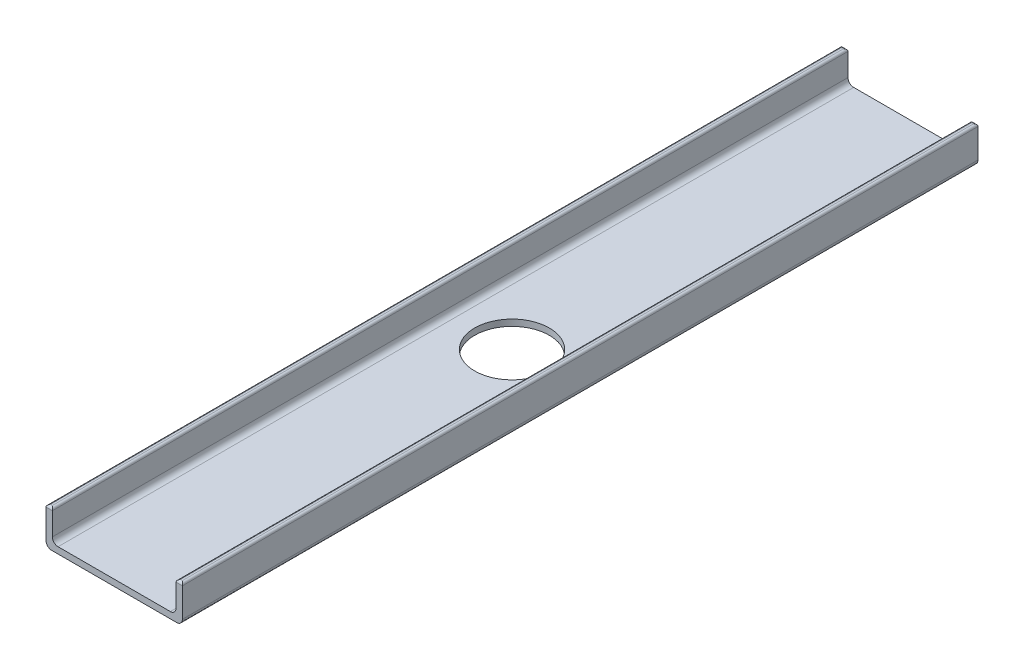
ISO-10303-21;
HEADER;
FILE_DESCRIPTION(('STEP AP214'),'2;1');
FILE_NAME('part.step','',(''),(''),'','','');
FILE_SCHEMA(('AUTOMOTIVE_DESIGN { 1 0 10303 214 1 1 1 1 }'));
ENDSEC;
DATA;
#1=APPLICATION_CONTEXT('core data for automotive mechanical design processes');
#2=APPLICATION_PROTOCOL_DEFINITION('international standard','automotive_design',2000,#1);
#3=PRODUCT_CONTEXT('',#1,'mechanical');
#4=PRODUCT('Part','Part','',(#3));
#5=PRODUCT_RELATED_PRODUCT_CATEGORY('part','',(#4));
#6=PRODUCT_DEFINITION_FORMATION('','',#4);
#7=PRODUCT_DEFINITION_CONTEXT('part definition',#1,'design');
#8=PRODUCT_DEFINITION('design','',#6,#7);
#9=PRODUCT_DEFINITION_SHAPE('','',#8);
#10=(LENGTH_UNIT() NAMED_UNIT(*) SI_UNIT(.MILLI.,.METRE.));
#11=(NAMED_UNIT(*) PLANE_ANGLE_UNIT() SI_UNIT($,.RADIAN.));
#12=(NAMED_UNIT(*) SI_UNIT($,.STERADIAN.) SOLID_ANGLE_UNIT());
#13=UNCERTAINTY_MEASURE_WITH_UNIT(LENGTH_MEASURE(1.E-05),#10,'distance_accuracy_value','');
#14=(GEOMETRIC_REPRESENTATION_CONTEXT(3) GLOBAL_UNCERTAINTY_ASSIGNED_CONTEXT((#13)) GLOBAL_UNIT_ASSIGNED_CONTEXT((#10,
#11,#12)) REPRESENTATION_CONTEXT('',''));
#15=CARTESIAN_POINT('',(0.,0.,0.));
#16=DIRECTION('',(0.,0.,1.));
#17=DIRECTION('',(1.,0.,0.));
#18=AXIS2_PLACEMENT_3D('',#15,#16,#17);
#19=CARTESIAN_POINT('',(-76.2,41.275,-863.6));
#20=DIRECTION('',(-1.,0.,0.));
#21=DIRECTION('',(0.,0.,1.));
#22=AXIS2_PLACEMENT_3D('',#19,#20,#21);
#23=PLANE('',#22);
#24=DIRECTION('',(0.,-1.,0.));
#25=VECTOR('',#24,1.);
#26=CARTESIAN_POINT('',(-76.2,41.275,25.4));
#27=LINE('',#26,#25);
#28=CARTESIAN_POINT('',(-76.2,38.735,25.4));
#29=VERTEX_POINT('',#28);
#30=CARTESIAN_POINT('',(-76.2,6.35,25.4));
#31=VERTEX_POINT('',#30);
#32=EDGE_CURVE('E242',#29,#31,#27,.T.);
#33=ORIENTED_EDGE('',*,*,#32,.F.);
#34=DIRECTION('',(0.,0.,1.));
#35=VECTOR('',#34,1.);
#36=CARTESIAN_POINT('',(-76.2,38.735,-863.6));
#37=LINE('',#36,#35);
#38=CARTESIAN_POINT('',(-76.2,38.735,-863.6));
#39=VERTEX_POINT('',#38);
#40=EDGE_CURVE('E43',#29,#39,#37,.F.);
#41=ORIENTED_EDGE('',*,*,#40,.T.);
#42=DIRECTION('',(0.,-1.,0.));
#43=VECTOR('',#42,1.);
#44=CARTESIAN_POINT('',(-76.2,41.275,-863.6));
#45=LINE('',#44,#43);
#46=CARTESIAN_POINT('',(-76.2,6.35,-863.6));
#47=VERTEX_POINT('',#46);
#48=EDGE_CURVE('E159',#39,#47,#45,.T.);
#49=ORIENTED_EDGE('',*,*,#48,.T.);
#50=DIRECTION('',(0.,0.,1.));
#51=VECTOR('',#50,1.);
#52=CARTESIAN_POINT('',(-76.2,6.35,-863.6));
#53=LINE('',#52,#51);
#54=EDGE_CURVE('E169',#47,#31,#53,.T.);
#55=ORIENTED_EDGE('',*,*,#54,.T.);
#56=EDGE_LOOP('',(#33,#41,#49,#55));
#57=FACE_BOUND('',#56,.T.);
#58=ADVANCED_FACE('F35',(#57),#23,.T.);
#59=CARTESIAN_POINT('',(-69.088,41.275,-863.6));
#60=DIRECTION('',(0.,1.,0.));
#61=DIRECTION('',(0.,0.,1.));
#62=AXIS2_PLACEMENT_3D('',#59,#60,#61);
#63=PLANE('',#62);
#64=DIRECTION('',(0.,0.,1.));
#65=VECTOR('',#64,1.);
#66=CARTESIAN_POINT('',(-73.66,41.275,-863.6));
#67=LINE('',#66,#65);
#68=CARTESIAN_POINT('',(-73.66,41.275,-861.06));
#69=VERTEX_POINT('',#68);
#70=CARTESIAN_POINT('',(-73.66,41.275,22.86));
#71=VERTEX_POINT('',#70);
#72=EDGE_CURVE('E50',#69,#71,#67,.T.);
#73=ORIENTED_EDGE('',*,*,#72,.T.);
#74=DIRECTION('',(-1.,0.,0.));
#75=VECTOR('',#74,1.);
#76=CARTESIAN_POINT('',(-69.088,41.275,22.86));
#77=LINE('',#76,#75);
#78=CARTESIAN_POINT('',(-71.628,41.275,22.86));
#79=VERTEX_POINT('',#78);
#80=EDGE_CURVE('E237',#71,#79,#77,.F.);
#81=ORIENTED_EDGE('',*,*,#80,.T.);
#82=DIRECTION('',(0.,0.,1.));
#83=VECTOR('',#82,1.);
#84=CARTESIAN_POINT('',(-71.628,41.275,-863.6));
#85=LINE('',#84,#83);
#86=CARTESIAN_POINT('',(-71.628,41.275,-861.06));
#87=VERTEX_POINT('',#86);
#88=EDGE_CURVE('E233',#79,#87,#85,.F.);
#89=ORIENTED_EDGE('',*,*,#88,.T.);
#90=DIRECTION('',(-1.,0.,0.));
#91=VECTOR('',#90,1.);
#92=CARTESIAN_POINT('',(-69.088,41.275,-861.06));
#93=LINE('',#92,#91);
#94=EDGE_CURVE('E55',#87,#69,#93,.T.);
#95=ORIENTED_EDGE('',*,*,#94,.T.);
#96=EDGE_LOOP('',(#73,#81,#89,#95));
#97=FACE_BOUND('',#96,.T.);
#98=ADVANCED_FACE('F37',(#97),#63,.T.);
#99=CARTESIAN_POINT('',(-69.088,7.11200000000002,-863.6));
#100=DIRECTION('',(1.,0.,0.));
#101=DIRECTION('',(0.,0.,-1.));
#102=AXIS2_PLACEMENT_3D('',#99,#100,#101);
#103=PLANE('',#102);
#104=DIRECTION('',(0.,1.,0.));
#105=VECTOR('',#104,1.);
#106=CARTESIAN_POINT('',(-69.088,7.11200000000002,-863.6));
#107=LINE('',#106,#105);
#108=CARTESIAN_POINT('',(-69.088,13.462,-863.6));
#109=VERTEX_POINT('',#108);
#110=CARTESIAN_POINT('',(-69.088,38.735,-863.6));
#111=VERTEX_POINT('',#110);
#112=EDGE_CURVE('E175',#109,#111,#107,.T.);
#113=ORIENTED_EDGE('',*,*,#112,.T.);
#114=DIRECTION('',(0.,0.,1.));
#115=VECTOR('',#114,1.);
#116=CARTESIAN_POINT('',(-69.088,38.735,-863.6));
#117=LINE('',#116,#115);
#118=CARTESIAN_POINT('',(-69.088,38.735,25.4));
#119=VERTEX_POINT('',#118);
#120=EDGE_CURVE('E11',#111,#119,#117,.T.);
#121=ORIENTED_EDGE('',*,*,#120,.T.);
#122=DIRECTION('',(0.,1.,0.));
#123=VECTOR('',#122,1.);
#124=CARTESIAN_POINT('',(-69.088,7.11200000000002,25.4));
#125=LINE('',#124,#123);
#126=CARTESIAN_POINT('',(-69.088,13.462,25.4));
#127=VERTEX_POINT('',#126);
#128=EDGE_CURVE('E249',#127,#119,#125,.T.);
#129=ORIENTED_EDGE('',*,*,#128,.F.);
#130=DIRECTION('',(0.,0.,1.));
#131=VECTOR('',#130,1.);
#132=CARTESIAN_POINT('',(-69.088,13.462,-863.6));
#133=LINE('',#132,#131);
#134=EDGE_CURVE('E196',#127,#109,#133,.F.);
#135=ORIENTED_EDGE('',*,*,#134,.T.);
#136=EDGE_LOOP('',(#113,#121,#129,#135));
#137=FACE_BOUND('',#136,.T.);
#138=ADVANCED_FACE('F314',(#137),#103,.T.);
#139=CARTESIAN_POINT('',(69.088,7.112,-863.6));
#140=DIRECTION('',(0.,1.,0.));
#141=DIRECTION('',(-1.,0.,0.));
#142=AXIS2_PLACEMENT_3D('',#139,#140,#141);
#143=PLANE('',#142);
#144=CARTESIAN_POINT('',(0.,7.11200000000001,-419.1));
#145=DIRECTION('',(0.,1.,0.));
#146=DIRECTION('',(-1.,0.,0.));
#147=AXIS2_PLACEMENT_3D('',#144,#145,#146);
#148=CIRCLE('',#147,41.656);
#149=CARTESIAN_POINT('',(-41.656,7.11200000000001,-419.1));
#150=VERTEX_POINT('',#149);
#151=EDGE_CURVE('E276',#150,#150,#148,.T.);
#152=ORIENTED_EDGE('',*,*,#151,.F.);
#153=EDGE_LOOP('',(#152));
#154=FACE_BOUND('',#153,.T.);
#155=DIRECTION('',(-1.,0.,0.));
#156=VECTOR('',#155,1.);
#157=CARTESIAN_POINT('',(69.088,7.112,-863.6));
#158=LINE('',#157,#156);
#159=CARTESIAN_POINT('',(62.738,7.112,-863.6));
#160=VERTEX_POINT('',#159);
#161=CARTESIAN_POINT('',(-62.738,7.11200000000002,-863.6));
#162=VERTEX_POINT('',#161);
#163=EDGE_CURVE('E179',#160,#162,#158,.T.);
#164=ORIENTED_EDGE('',*,*,#163,.T.);
#165=DIRECTION('',(0.,0.,1.));
#166=VECTOR('',#165,1.);
#167=CARTESIAN_POINT('',(-62.738,7.11200000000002,-863.6));
#168=LINE('',#167,#166);
#169=CARTESIAN_POINT('',(-62.738,7.11200000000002,25.4));
#170=VERTEX_POINT('',#169);
#171=EDGE_CURVE('E193',#162,#170,#168,.T.);
#172=ORIENTED_EDGE('',*,*,#171,.T.);
#173=DIRECTION('',(-1.,0.,0.));
#174=VECTOR('',#173,1.);
#175=CARTESIAN_POINT('',(69.088,7.112,25.4));
#176=LINE('',#175,#174);
#177=CARTESIAN_POINT('',(62.738,7.112,25.4));
#178=VERTEX_POINT('',#177);
#179=EDGE_CURVE('E290',#178,#170,#176,.T.);
#180=ORIENTED_EDGE('',*,*,#179,.F.);
#181=DIRECTION('',(0.,0.,1.));
#182=VECTOR('',#181,1.);
#183=CARTESIAN_POINT('',(62.738,7.112,-863.6));
#184=LINE('',#183,#182);
#185=EDGE_CURVE('E191',#178,#160,#184,.F.);
#186=ORIENTED_EDGE('',*,*,#185,.T.);
#187=EDGE_LOOP('',(#164,#172,#180,#186));
#188=FACE_BOUND('',#187,.T.);
#189=ADVANCED_FACE('F301',(#154,#188),#143,.T.);
#190=CARTESIAN_POINT('',(69.088,41.275,-863.6));
#191=DIRECTION('',(-1.,0.,0.));
#192=DIRECTION('',(0.,0.,1.));
#193=AXIS2_PLACEMENT_3D('',#190,#191,#192);
#194=PLANE('',#193);
#195=DIRECTION('',(0.,-1.,0.));
#196=VECTOR('',#195,1.);
#197=CARTESIAN_POINT('',(69.088,41.275,25.4));
#198=LINE('',#197,#196);
#199=CARTESIAN_POINT('',(69.088,38.735,25.4));
#200=VERTEX_POINT('',#199);
#201=CARTESIAN_POINT('',(69.088,13.462,25.4));
#202=VERTEX_POINT('',#201);
#203=EDGE_CURVE('E288',#200,#202,#198,.T.);
#204=ORIENTED_EDGE('',*,*,#203,.F.);
#205=DIRECTION('',(0.,0.,1.));
#206=VECTOR('',#205,1.);
#207=CARTESIAN_POINT('',(69.088,38.735,-863.6));
#208=LINE('',#207,#206);
#209=CARTESIAN_POINT('',(69.088,38.735,-863.6));
#210=VERTEX_POINT('',#209);
#211=EDGE_CURVE('E225',#200,#210,#208,.F.);
#212=ORIENTED_EDGE('',*,*,#211,.T.);
#213=DIRECTION('',(0.,-1.,0.));
#214=VECTOR('',#213,1.);
#215=CARTESIAN_POINT('',(69.088,41.275,-863.6));
#216=LINE('',#215,#214);
#217=CARTESIAN_POINT('',(69.088,13.462,-863.6));
#218=VERTEX_POINT('',#217);
#219=EDGE_CURVE('E296',#210,#218,#216,.T.);
#220=ORIENTED_EDGE('',*,*,#219,.T.);
#221=DIRECTION('',(0.,0.,1.));
#222=VECTOR('',#221,1.);
#223=CARTESIAN_POINT('',(69.088,13.462,-863.6));
#224=LINE('',#223,#222);
#225=EDGE_CURVE('E198',#218,#202,#224,.T.);
#226=ORIENTED_EDGE('',*,*,#225,.T.);
#227=EDGE_LOOP('',(#204,#212,#220,#226));
#228=FACE_BOUND('',#227,.T.);
#229=ADVANCED_FACE('F352',(#228),#194,.T.);
#230=CARTESIAN_POINT('',(76.2,41.275,-863.6));
#231=DIRECTION('',(0.,1.,0.));
#232=DIRECTION('',(0.,0.,1.));
#233=AXIS2_PLACEMENT_3D('',#230,#231,#232);
#234=PLANE('',#233);
#235=DIRECTION('',(0.,0.,1.));
#236=VECTOR('',#235,1.);
#237=CARTESIAN_POINT('',(71.628,41.275,-863.6));
#238=LINE('',#237,#236);
#239=CARTESIAN_POINT('',(71.628,41.275,-861.06));
#240=VERTEX_POINT('',#239);
#241=CARTESIAN_POINT('',(71.628,41.275,22.86));
#242=VERTEX_POINT('',#241);
#243=EDGE_CURVE('E220',#240,#242,#238,.T.);
#244=ORIENTED_EDGE('',*,*,#243,.T.);
#245=DIRECTION('',(-1.,0.,0.));
#246=VECTOR('',#245,1.);
#247=CARTESIAN_POINT('',(76.2,41.275,22.86));
#248=LINE('',#247,#246);
#249=CARTESIAN_POINT('',(73.66,41.275,22.86));
#250=VERTEX_POINT('',#249);
#251=EDGE_CURVE('E222',#242,#250,#248,.F.);
#252=ORIENTED_EDGE('',*,*,#251,.T.);
#253=DIRECTION('',(0.,0.,1.));
#254=VECTOR('',#253,1.);
#255=CARTESIAN_POINT('',(73.66,41.275,-863.6));
#256=LINE('',#255,#254);
#257=CARTESIAN_POINT('',(73.66,41.275,-861.06));
#258=VERTEX_POINT('',#257);
#259=EDGE_CURVE('E216',#250,#258,#256,.F.);
#260=ORIENTED_EDGE('',*,*,#259,.T.);
#261=DIRECTION('',(-1.,0.,0.));
#262=VECTOR('',#261,1.);
#263=CARTESIAN_POINT('',(76.2,41.275,-861.06));
#264=LINE('',#263,#262);
#265=EDGE_CURVE('E218',#258,#240,#264,.T.);
#266=ORIENTED_EDGE('',*,*,#265,.T.);
#267=EDGE_LOOP('',(#244,#252,#260,#266));
#268=FACE_BOUND('',#267,.T.);
#269=ADVANCED_FACE('F348',(#268),#234,.T.);
#270=CARTESIAN_POINT('',(76.2,0.,-863.6));
#271=DIRECTION('',(1.,0.,0.));
#272=DIRECTION('',(0.,0.,-1.));
#273=AXIS2_PLACEMENT_3D('',#270,#271,#272);
#274=PLANE('',#273);
#275=DIRECTION('',(0.,1.,0.));
#276=VECTOR('',#275,1.);
#277=CARTESIAN_POINT('',(76.2,0.,-863.6));
#278=LINE('',#277,#276);
#279=CARTESIAN_POINT('',(76.2,6.35,-863.6));
#280=VERTEX_POINT('',#279);
#281=CARTESIAN_POINT('',(76.2,38.735,-863.6));
#282=VERTEX_POINT('',#281);
#283=EDGE_CURVE('E158',#280,#282,#278,.T.);
#284=ORIENTED_EDGE('',*,*,#283,.T.);
#285=DIRECTION('',(0.,0.,1.));
#286=VECTOR('',#285,1.);
#287=CARTESIAN_POINT('',(76.2,38.735,-863.6));
#288=LINE('',#287,#286);
#289=CARTESIAN_POINT('',(76.2,38.735,25.4));
#290=VERTEX_POINT('',#289);
#291=EDGE_CURVE('E231',#282,#290,#288,.T.);
#292=ORIENTED_EDGE('',*,*,#291,.T.);
#293=DIRECTION('',(0.,1.,0.));
#294=VECTOR('',#293,1.);
#295=CARTESIAN_POINT('',(76.2,0.,25.4));
#296=LINE('',#295,#294);
#297=CARTESIAN_POINT('',(76.2,6.35,25.4));
#298=VERTEX_POINT('',#297);
#299=EDGE_CURVE('E285',#298,#290,#296,.T.);
#300=ORIENTED_EDGE('',*,*,#299,.F.);
#301=DIRECTION('',(0.,0.,1.));
#302=VECTOR('',#301,1.);
#303=CARTESIAN_POINT('',(76.2,6.35,-863.6));
#304=LINE('',#303,#302);
#305=EDGE_CURVE('E170',#298,#280,#304,.F.);
#306=ORIENTED_EDGE('',*,*,#305,.T.);
#307=EDGE_LOOP('',(#284,#292,#300,#306));
#308=FACE_BOUND('',#307,.T.);
#309=ADVANCED_FACE('F344',(#308),#274,.T.);
#310=CARTESIAN_POINT('',(-76.2,0.,-863.6));
#311=DIRECTION('',(0.,-1.,0.));
#312=DIRECTION('',(0.,0.,-1.));
#313=AXIS2_PLACEMENT_3D('',#310,#311,#312);
#314=PLANE('',#313);
#315=CARTESIAN_POINT('',(0.,0.,-419.1));
#316=DIRECTION('',(0.,1.,0.));
#317=DIRECTION('',(-1.,0.,0.));
#318=AXIS2_PLACEMENT_3D('',#315,#316,#317);
#319=CIRCLE('',#318,41.656);
#320=CARTESIAN_POINT('',(-41.656,0.,-419.1));
#321=VERTEX_POINT('',#320);
#322=EDGE_CURVE('E279',#321,#321,#319,.T.);
#323=ORIENTED_EDGE('',*,*,#322,.T.);
#324=EDGE_LOOP('',(#323));
#325=FACE_BOUND('',#324,.T.);
#326=DIRECTION('',(1.,0.,0.));
#327=VECTOR('',#326,1.);
#328=CARTESIAN_POINT('',(-76.2,0.,25.4));
#329=LINE('',#328,#327);
#330=CARTESIAN_POINT('',(-69.85,0.,25.4));
#331=VERTEX_POINT('',#330);
#332=CARTESIAN_POINT('',(69.85,0.,25.4));
#333=VERTEX_POINT('',#332);
#334=EDGE_CURVE('E283',#331,#333,#329,.T.);
#335=ORIENTED_EDGE('',*,*,#334,.F.);
#336=DIRECTION('',(0.,0.,1.));
#337=VECTOR('',#336,1.);
#338=CARTESIAN_POINT('',(-69.85,0.,-863.6));
#339=LINE('',#338,#337);
#340=CARTESIAN_POINT('',(-69.85,0.,-863.6));
#341=VERTEX_POINT('',#340);
#342=EDGE_CURVE('E154',#331,#341,#339,.F.);
#343=ORIENTED_EDGE('',*,*,#342,.T.);
#344=DIRECTION('',(1.,0.,0.));
#345=VECTOR('',#344,1.);
#346=CARTESIAN_POINT('',(-76.2,0.,-863.6));
#347=LINE('',#346,#345);
#348=CARTESIAN_POINT('',(69.85,0.,-863.6));
#349=VERTEX_POINT('',#348);
#350=EDGE_CURVE('E147',#341,#349,#347,.T.);
#351=ORIENTED_EDGE('',*,*,#350,.T.);
#352=DIRECTION('',(0.,0.,1.));
#353=VECTOR('',#352,1.);
#354=CARTESIAN_POINT('',(69.85,0.,-863.6));
#355=LINE('',#354,#353);
#356=EDGE_CURVE('E152',#349,#333,#355,.T.);
#357=ORIENTED_EDGE('',*,*,#356,.T.);
#358=EDGE_LOOP('',(#335,#343,#351,#357));
#359=FACE_BOUND('',#358,.T.);
#360=ADVANCED_FACE('F150',(#325,#359),#314,.T.);
#361=CARTESIAN_POINT('',(-76.2,0.,-863.6));
#362=DIRECTION('',(0.,0.,1.));
#363=DIRECTION('',(1.,0.,0.));
#364=AXIS2_PLACEMENT_3D('',#361,#362,#363);
#365=PLANE('',#364);
#366=ORIENTED_EDGE('',*,*,#219,.F.);
#367=DIRECTION('',(-1.,0.,0.));
#368=VECTOR('',#367,1.);
#369=CARTESIAN_POINT('',(76.2,38.735,-863.6));
#370=LINE('',#369,#368);
#371=EDGE_CURVE('E229',#210,#282,#370,.F.);
#372=ORIENTED_EDGE('',*,*,#371,.T.);
#373=ORIENTED_EDGE('',*,*,#283,.F.);
#374=CARTESIAN_POINT('',(69.85,6.35,-863.6));
#375=DIRECTION('',(0.,0.,1.));
#376=DIRECTION('',(1.,0.,0.));
#377=AXIS2_PLACEMENT_3D('',#374,#375,#376);
#378=CIRCLE('',#377,6.35);
#379=EDGE_CURVE('E163',#280,#349,#378,.F.);
#380=ORIENTED_EDGE('',*,*,#379,.T.);
#381=ORIENTED_EDGE('',*,*,#350,.F.);
#382=CARTESIAN_POINT('',(-69.85,6.35,-863.6));
#383=DIRECTION('',(0.,0.,1.));
#384=DIRECTION('',(1.,0.,0.));
#385=AXIS2_PLACEMENT_3D('',#382,#383,#384);
#386=CIRCLE('',#385,6.35);
#387=EDGE_CURVE('E189',#341,#47,#386,.F.);
#388=ORIENTED_EDGE('',*,*,#387,.T.);
#389=ORIENTED_EDGE('',*,*,#48,.F.);
#390=DIRECTION('',(-1.,0.,0.));
#391=VECTOR('',#390,1.);
#392=CARTESIAN_POINT('',(-69.088,38.735,-863.6));
#393=LINE('',#392,#391);
#394=EDGE_CURVE('E227',#39,#111,#393,.F.);
#395=ORIENTED_EDGE('',*,*,#394,.T.);
#396=ORIENTED_EDGE('',*,*,#112,.F.);
#397=CARTESIAN_POINT('',(-62.738,13.462,-863.6));
#398=DIRECTION('',(0.,0.,1.));
#399=DIRECTION('',(1.,0.,0.));
#400=AXIS2_PLACEMENT_3D('',#397,#398,#399);
#401=CIRCLE('',#400,6.35);
#402=EDGE_CURVE('E203',#109,#162,#401,.T.);
#403=ORIENTED_EDGE('',*,*,#402,.T.);
#404=ORIENTED_EDGE('',*,*,#163,.F.);
#405=CARTESIAN_POINT('',(62.738,13.462,-863.6));
#406=DIRECTION('',(0.,0.,1.));
#407=DIRECTION('',(1.,0.,0.));
#408=AXIS2_PLACEMENT_3D('',#405,#406,#407);
#409=CIRCLE('',#408,6.35);
#410=EDGE_CURVE('E207',#160,#218,#409,.T.);
#411=ORIENTED_EDGE('',*,*,#410,.T.);
#412=EDGE_LOOP('',(#366,#372,#373,#380,#381,#388,#389,#395,#396,#403,#404,#411));
#413=FACE_BOUND('',#412,.T.);
#414=ADVANCED_FACE('F165',(#413),#365,.F.);
#415=CARTESIAN_POINT('',(-76.2,0.,25.4));
#416=DIRECTION('',(0.,0.,1.));
#417=DIRECTION('',(1.,0.,0.));
#418=AXIS2_PLACEMENT_3D('',#415,#416,#417);
#419=PLANE('',#418);
#420=ORIENTED_EDGE('',*,*,#299,.T.);
#421=DIRECTION('',(-1.,0.,0.));
#422=VECTOR('',#421,1.);
#423=CARTESIAN_POINT('',(-76.2,38.735,25.4));
#424=LINE('',#423,#422);
#425=EDGE_CURVE('E213',#290,#200,#424,.T.);
#426=ORIENTED_EDGE('',*,*,#425,.T.);
#427=ORIENTED_EDGE('',*,*,#203,.T.);
#428=CARTESIAN_POINT('',(62.738,13.462,25.4));
#429=DIRECTION('',(0.,0.,1.));
#430=DIRECTION('',(1.,0.,0.));
#431=AXIS2_PLACEMENT_3D('',#428,#429,#430);
#432=CIRCLE('',#431,6.35);
#433=EDGE_CURVE('E205',#202,#178,#432,.F.);
#434=ORIENTED_EDGE('',*,*,#433,.T.);
#435=ORIENTED_EDGE('',*,*,#179,.T.);
#436=CARTESIAN_POINT('',(-62.738,13.462,25.4));
#437=DIRECTION('',(0.,0.,1.));
#438=DIRECTION('',(1.,0.,0.));
#439=AXIS2_PLACEMENT_3D('',#436,#437,#438);
#440=CIRCLE('',#439,6.35);
#441=EDGE_CURVE('E201',#170,#127,#440,.F.);
#442=ORIENTED_EDGE('',*,*,#441,.T.);
#443=ORIENTED_EDGE('',*,*,#128,.T.);
#444=DIRECTION('',(-1.,0.,0.));
#445=VECTOR('',#444,1.);
#446=CARTESIAN_POINT('',(-76.2,38.735,25.4));
#447=LINE('',#446,#445);
#448=EDGE_CURVE('E210',#119,#29,#447,.T.);
#449=ORIENTED_EDGE('',*,*,#448,.T.);
#450=ORIENTED_EDGE('',*,*,#32,.T.);
#451=CARTESIAN_POINT('',(-69.85,6.35,25.4));
#452=DIRECTION('',(0.,0.,1.));
#453=DIRECTION('',(1.,0.,0.));
#454=AXIS2_PLACEMENT_3D('',#451,#452,#453);
#455=CIRCLE('',#454,6.35);
#456=EDGE_CURVE('E186',#31,#331,#455,.T.);
#457=ORIENTED_EDGE('',*,*,#456,.T.);
#458=ORIENTED_EDGE('',*,*,#334,.T.);
#459=CARTESIAN_POINT('',(69.85,6.35,25.4));
#460=DIRECTION('',(0.,0.,1.));
#461=DIRECTION('',(1.,0.,0.));
#462=AXIS2_PLACEMENT_3D('',#459,#460,#461);
#463=CIRCLE('',#462,6.35);
#464=EDGE_CURVE('E174',#333,#298,#463,.T.);
#465=ORIENTED_EDGE('',*,*,#464,.T.);
#466=EDGE_LOOP('',(#420,#426,#427,#434,#435,#442,#443,#449,#450,#457,#458,#465));
#467=FACE_BOUND('',#466,.T.);
#468=ADVANCED_FACE('F311',(#467),#419,.T.);
#469=CARTESIAN_POINT('',(0.,0.,-419.1));
#470=DIRECTION('',(0.,1.,0.));
#471=DIRECTION('',(-1.,0.,0.));
#472=AXIS2_PLACEMENT_3D('',#469,#470,#471);
#473=CYLINDRICAL_SURFACE('',#472,41.656);
#474=ORIENTED_EDGE('',*,*,#322,.F.);
#475=EDGE_LOOP('',(#474));
#476=FACE_BOUND('',#475,.T.);
#477=ORIENTED_EDGE('',*,*,#151,.T.);
#478=EDGE_LOOP('',(#477));
#479=FACE_BOUND('',#478,.T.);
#480=ADVANCED_FACE('F332',(#476,#479),#473,.F.);
#481=CARTESIAN_POINT('',(69.85,6.35,-863.6));
#482=DIRECTION('',(0.,0.,1.));
#483=DIRECTION('',(1.,0.,0.));
#484=AXIS2_PLACEMENT_3D('',#481,#482,#483);
#485=CYLINDRICAL_SURFACE('',#484,6.35);
#486=ORIENTED_EDGE('',*,*,#379,.F.);
#487=ORIENTED_EDGE('',*,*,#305,.F.);
#488=ORIENTED_EDGE('',*,*,#464,.F.);
#489=ORIENTED_EDGE('',*,*,#356,.F.);
#490=EDGE_LOOP('',(#486,#487,#488,#489));
#491=FACE_BOUND('',#490,.T.);
#492=ADVANCED_FACE('F173',(#491),#485,.T.);
#493=CARTESIAN_POINT('',(-69.85,6.35,-863.6));
#494=DIRECTION('',(0.,0.,1.));
#495=DIRECTION('',(1.,0.,0.));
#496=AXIS2_PLACEMENT_3D('',#493,#494,#495);
#497=CYLINDRICAL_SURFACE('',#496,6.35);
#498=ORIENTED_EDGE('',*,*,#387,.F.);
#499=ORIENTED_EDGE('',*,*,#342,.F.);
#500=ORIENTED_EDGE('',*,*,#456,.F.);
#501=ORIENTED_EDGE('',*,*,#54,.F.);
#502=EDGE_LOOP('',(#498,#499,#500,#501));
#503=FACE_BOUND('',#502,.T.);
#504=ADVANCED_FACE('F323',(#503),#497,.T.);
#505=CARTESIAN_POINT('',(-62.738,13.462,-863.6));
#506=DIRECTION('',(0.,0.,-1.));
#507=DIRECTION('',(-1.,0.,0.));
#508=AXIS2_PLACEMENT_3D('',#505,#506,#507);
#509=CYLINDRICAL_SURFACE('',#508,6.35);
#510=ORIENTED_EDGE('',*,*,#402,.F.);
#511=ORIENTED_EDGE('',*,*,#134,.F.);
#512=ORIENTED_EDGE('',*,*,#441,.F.);
#513=ORIENTED_EDGE('',*,*,#171,.F.);
#514=EDGE_LOOP('',(#510,#511,#512,#513));
#515=FACE_BOUND('',#514,.T.);
#516=ADVANCED_FACE('F307',(#515),#509,.F.);
#517=CARTESIAN_POINT('',(62.738,13.462,-863.6));
#518=DIRECTION('',(0.,0.,-1.));
#519=DIRECTION('',(-1.,0.,0.));
#520=AXIS2_PLACEMENT_3D('',#517,#518,#519);
#521=CYLINDRICAL_SURFACE('',#520,6.35);
#522=ORIENTED_EDGE('',*,*,#410,.F.);
#523=ORIENTED_EDGE('',*,*,#185,.F.);
#524=ORIENTED_EDGE('',*,*,#433,.F.);
#525=ORIENTED_EDGE('',*,*,#225,.F.);
#526=EDGE_LOOP('',(#522,#523,#524,#525));
#527=FACE_BOUND('',#526,.T.);
#528=ADVANCED_FACE('F330',(#527),#521,.F.);
#529=CARTESIAN_POINT('',(76.2,38.735,-861.06));
#530=DIRECTION('',(1.,0.,0.));
#531=DIRECTION('',(0.,0.,-1.));
#532=AXIS2_PLACEMENT_3D('',#529,#530,#531);
#533=CYLINDRICAL_SURFACE('',#532,2.54);
#534=CARTESIAN_POINT('',(71.628,38.735,-861.06));
#535=DIRECTION('',(0.707106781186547,0.,-0.707106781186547));
#536=DIRECTION('',(0.707106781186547,0.,0.707106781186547));
#537=AXIS2_PLACEMENT_3D('',#534,#535,#536);
#538=ELLIPSE('',#537,3.59210244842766,2.54);
#539=EDGE_CURVE('E270',#240,#210,#538,.F.);
#540=ORIENTED_EDGE('',*,*,#539,.F.);
#541=ORIENTED_EDGE('',*,*,#265,.F.);
#542=CARTESIAN_POINT('',(73.66,38.735,-861.06));
#543=DIRECTION('',(0.707106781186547,0.,0.707106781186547));
#544=DIRECTION('',(-0.707106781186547,0.,0.707106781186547));
#545=AXIS2_PLACEMENT_3D('',#542,#543,#544);
#546=ELLIPSE('',#545,3.59210244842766,2.54);
#547=EDGE_CURVE('E273',#282,#258,#546,.T.);
#548=ORIENTED_EDGE('',*,*,#547,.F.);
#549=ORIENTED_EDGE('',*,*,#371,.F.);
#550=EDGE_LOOP('',(#540,#541,#548,#549));
#551=FACE_BOUND('',#550,.T.);
#552=ADVANCED_FACE('F418',(#551),#533,.T.);
#553=CARTESIAN_POINT('',(73.66,38.735,-863.6));
#554=DIRECTION('',(0.,0.,1.));
#555=DIRECTION('',(1.,0.,0.));
#556=AXIS2_PLACEMENT_3D('',#553,#554,#555);
#557=CYLINDRICAL_SURFACE('',#556,2.54);
#558=ORIENTED_EDGE('',*,*,#547,.T.);
#559=ORIENTED_EDGE('',*,*,#259,.F.);
#560=CARTESIAN_POINT('',(73.66,38.735,22.86));
#561=DIRECTION('',(-0.707106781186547,0.,0.707106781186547));
#562=DIRECTION('',(0.707106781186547,0.,0.707106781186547));
#563=AXIS2_PLACEMENT_3D('',#560,#561,#562);
#564=ELLIPSE('',#563,3.59210244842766,2.54);
#565=EDGE_CURVE('E268',#290,#250,#564,.T.);
#566=ORIENTED_EDGE('',*,*,#565,.F.);
#567=ORIENTED_EDGE('',*,*,#291,.F.);
#568=EDGE_LOOP('',(#558,#559,#566,#567));
#569=FACE_BOUND('',#568,.T.);
#570=ADVANCED_FACE('F426',(#569),#557,.T.);
#571=CARTESIAN_POINT('',(71.628,38.735,-863.6));
#572=DIRECTION('',(0.,0.,1.));
#573=DIRECTION('',(1.,0.,0.));
#574=AXIS2_PLACEMENT_3D('',#571,#572,#573);
#575=CYLINDRICAL_SURFACE('',#574,2.54);
#576=ORIENTED_EDGE('',*,*,#539,.T.);
#577=ORIENTED_EDGE('',*,*,#211,.F.);
#578=CARTESIAN_POINT('',(71.628,38.735,22.86));
#579=DIRECTION('',(0.707106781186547,0.,0.707106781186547));
#580=DIRECTION('',(-0.707106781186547,0.,0.707106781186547));
#581=AXIS2_PLACEMENT_3D('',#578,#579,#580);
#582=ELLIPSE('',#581,3.59210244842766,2.54);
#583=EDGE_CURVE('E261',#242,#200,#582,.T.);
#584=ORIENTED_EDGE('',*,*,#583,.F.);
#585=ORIENTED_EDGE('',*,*,#243,.F.);
#586=EDGE_LOOP('',(#576,#577,#584,#585));
#587=FACE_BOUND('',#586,.T.);
#588=ADVANCED_FACE('F434',(#587),#575,.T.);
#589=CARTESIAN_POINT('',(-76.2,38.735,22.86));
#590=DIRECTION('',(-1.,0.,0.));
#591=DIRECTION('',(0.,0.,1.));
#592=AXIS2_PLACEMENT_3D('',#589,#590,#591);
#593=CYLINDRICAL_SURFACE('',#592,2.54);
#594=ORIENTED_EDGE('',*,*,#565,.T.);
#595=ORIENTED_EDGE('',*,*,#251,.F.);
#596=ORIENTED_EDGE('',*,*,#583,.T.);
#597=ORIENTED_EDGE('',*,*,#425,.F.);
#598=EDGE_LOOP('',(#594,#595,#596,#597));
#599=FACE_BOUND('',#598,.T.);
#600=ADVANCED_FACE('F442',(#599),#593,.T.);
#601=CARTESIAN_POINT('',(-69.088,38.735,-861.06));
#602=DIRECTION('',(1.,0.,0.));
#603=DIRECTION('',(0.,0.,-1.));
#604=AXIS2_PLACEMENT_3D('',#601,#602,#603);
#605=CYLINDRICAL_SURFACE('',#604,2.54);
#606=CARTESIAN_POINT('',(-73.66,38.735,-861.06));
#607=DIRECTION('',(0.707106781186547,0.,-0.707106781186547));
#608=DIRECTION('',(0.707106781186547,0.,0.707106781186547));
#609=AXIS2_PLACEMENT_3D('',#606,#607,#608);
#610=ELLIPSE('',#609,3.59210244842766,2.54);
#611=EDGE_CURVE('E254',#69,#39,#610,.F.);
#612=ORIENTED_EDGE('',*,*,#611,.F.);
#613=ORIENTED_EDGE('',*,*,#94,.F.);
#614=CARTESIAN_POINT('',(-71.628,38.735,-861.06));
#615=DIRECTION('',(0.707106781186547,0.,0.707106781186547));
#616=DIRECTION('',(-0.707106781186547,0.,0.707106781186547));
#617=AXIS2_PLACEMENT_3D('',#614,#615,#616);
#618=ELLIPSE('',#617,3.59210244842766,2.54);
#619=EDGE_CURVE('E256',#111,#87,#618,.T.);
#620=ORIENTED_EDGE('',*,*,#619,.F.);
#621=ORIENTED_EDGE('',*,*,#394,.F.);
#622=EDGE_LOOP('',(#612,#613,#620,#621));
#623=FACE_BOUND('',#622,.T.);
#624=ADVANCED_FACE('F253',(#623),#605,.T.);
#625=CARTESIAN_POINT('',(-71.628,38.735,-863.6));
#626=DIRECTION('',(0.,0.,1.));
#627=DIRECTION('',(1.,0.,0.));
#628=AXIS2_PLACEMENT_3D('',#625,#626,#627);
#629=CYLINDRICAL_SURFACE('',#628,2.54);
#630=ORIENTED_EDGE('',*,*,#619,.T.);
#631=ORIENTED_EDGE('',*,*,#88,.F.);
#632=CARTESIAN_POINT('',(-71.628,38.735,22.86));
#633=DIRECTION('',(-0.707106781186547,0.,0.707106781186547));
#634=DIRECTION('',(0.707106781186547,0.,0.707106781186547));
#635=AXIS2_PLACEMENT_3D('',#632,#633,#634);
#636=ELLIPSE('',#635,3.59210244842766,2.54);
#637=EDGE_CURVE('E259',#119,#79,#636,.T.);
#638=ORIENTED_EDGE('',*,*,#637,.F.);
#639=ORIENTED_EDGE('',*,*,#120,.F.);
#640=EDGE_LOOP('',(#630,#631,#638,#639));
#641=FACE_BOUND('',#640,.T.);
#642=ADVANCED_FACE('F316',(#641),#629,.T.);
#643=CARTESIAN_POINT('',(-73.66,38.735,-863.6));
#644=DIRECTION('',(0.,0.,1.));
#645=DIRECTION('',(1.,0.,0.));
#646=AXIS2_PLACEMENT_3D('',#643,#644,#645);
#647=CYLINDRICAL_SURFACE('',#646,2.54);
#648=ORIENTED_EDGE('',*,*,#611,.T.);
#649=ORIENTED_EDGE('',*,*,#40,.F.);
#650=CARTESIAN_POINT('',(-73.66,38.735,22.86));
#651=DIRECTION('',(0.707106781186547,0.,0.707106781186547));
#652=DIRECTION('',(-0.707106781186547,0.,0.707106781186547));
#653=AXIS2_PLACEMENT_3D('',#650,#651,#652);
#654=ELLIPSE('',#653,3.59210244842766,2.54);
#655=EDGE_CURVE('E263',#71,#29,#654,.T.);
#656=ORIENTED_EDGE('',*,*,#655,.F.);
#657=ORIENTED_EDGE('',*,*,#72,.F.);
#658=EDGE_LOOP('',(#648,#649,#656,#657));
#659=FACE_BOUND('',#658,.T.);
#660=ADVANCED_FACE('F258',(#659),#647,.T.);
#661=CARTESIAN_POINT('',(-76.2,38.735,22.86));
#662=DIRECTION('',(-1.,0.,0.));
#663=DIRECTION('',(0.,0.,1.));
#664=AXIS2_PLACEMENT_3D('',#661,#662,#663);
#665=CYLINDRICAL_SURFACE('',#664,2.54);
#666=ORIENTED_EDGE('',*,*,#637,.T.);
#667=ORIENTED_EDGE('',*,*,#80,.F.);
#668=ORIENTED_EDGE('',*,*,#655,.T.);
#669=ORIENTED_EDGE('',*,*,#448,.F.);
#670=EDGE_LOOP('',(#666,#667,#668,#669));
#671=FACE_BOUND('',#670,.T.);
#672=ADVANCED_FACE('F320',(#671),#665,.T.);
#673=CLOSED_SHELL('',(#58,#98,#138,#189,#229,#269,#309,#360,#414,#468,#480,#492,#504,#516,#528,
#552,#570,#588,#600,#624,#642,#660,#672));
#674=MANIFOLD_SOLID_BREP('B2',#673);
#675=ADVANCED_BREP_SHAPE_REPRESENTATION('',(#18,#674),#14);
#676=SHAPE_DEFINITION_REPRESENTATION(#9,#675);
ENDSEC;
END-ISO-10303-21;
